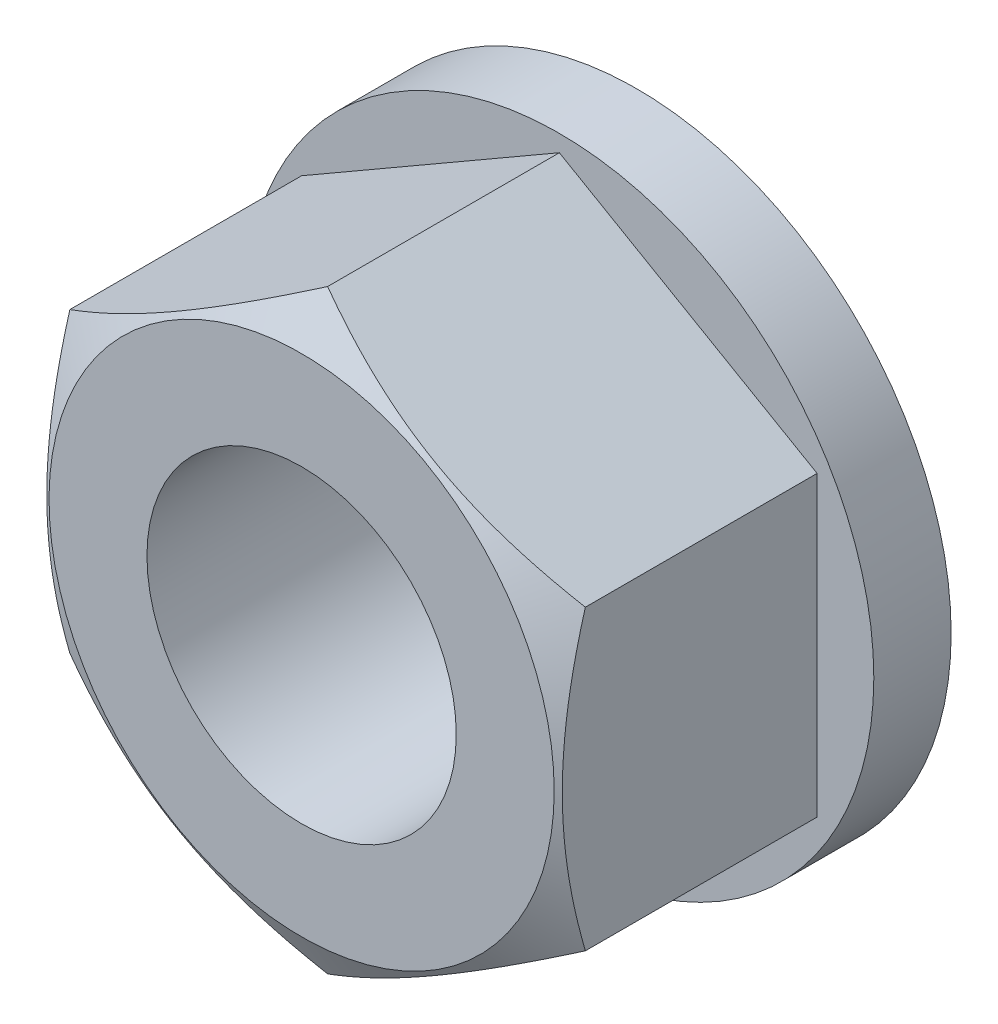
ISO-10303-21;
HEADER;
FILE_DESCRIPTION(('STEP AP214'),'2;1');
FILE_NAME('part.step','',(''),(''),'','','');
FILE_SCHEMA(('AUTOMOTIVE_DESIGN { 1 0 10303 214 1 1 1 1 }'));
ENDSEC;
DATA;
#1=APPLICATION_CONTEXT('core data for automotive mechanical design processes');
#2=APPLICATION_PROTOCOL_DEFINITION('international standard','automotive_design',2000,#1);
#3=PRODUCT_CONTEXT('',#1,'mechanical');
#4=PRODUCT('Part','Part','',(#3));
#5=PRODUCT_RELATED_PRODUCT_CATEGORY('part','',(#4));
#6=PRODUCT_DEFINITION_FORMATION('','',#4);
#7=PRODUCT_DEFINITION_CONTEXT('part definition',#1,'design');
#8=PRODUCT_DEFINITION('design','',#6,#7);
#9=PRODUCT_DEFINITION_SHAPE('','',#8);
#10=(LENGTH_UNIT() NAMED_UNIT(*) SI_UNIT(.MILLI.,.METRE.));
#11=(NAMED_UNIT(*) PLANE_ANGLE_UNIT() SI_UNIT($,.RADIAN.));
#12=(NAMED_UNIT(*) SI_UNIT($,.STERADIAN.) SOLID_ANGLE_UNIT());
#13=UNCERTAINTY_MEASURE_WITH_UNIT(LENGTH_MEASURE(1.E-05),#10,'distance_accuracy_value','');
#14=(GEOMETRIC_REPRESENTATION_CONTEXT(3) GLOBAL_UNCERTAINTY_ASSIGNED_CONTEXT((#13)) GLOBAL_UNIT_ASSIGNED_CONTEXT((#10,
#11,#12)) REPRESENTATION_CONTEXT('',''));
#15=CARTESIAN_POINT('',(0.,0.,0.));
#16=DIRECTION('',(0.,0.,1.));
#17=DIRECTION('',(1.,0.,0.));
#18=AXIS2_PLACEMENT_3D('',#15,#16,#17);
#19=CARTESIAN_POINT('',(5.,-5.842784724,6.5));
#20=DIRECTION('',(0.,0.,-1.));
#21=DIRECTION('',(-1.,0.,0.));
#22=AXIS2_PLACEMENT_3D('',#19,#20,#21);
#23=PLANE('',#22);
#24=CARTESIAN_POINT('',(0.,0.,6.5));
#25=DIRECTION('',(0.,0.,-1.));
#26=DIRECTION('',(0.,1.,0.));
#27=AXIS2_PLACEMENT_3D('',#24,#25,#26);
#28=CIRCLE('',#27,3.);
#29=CARTESIAN_POINT('',(0.,3.,6.5));
#30=VERTEX_POINT('',#29);
#31=EDGE_CURVE('E86',#30,#30,#28,.T.);
#32=ORIENTED_EDGE('',*,*,#31,.T.);
#33=EDGE_LOOP('',(#32));
#34=FACE_BOUND('',#33,.T.);
#35=CARTESIAN_POINT('',(0.,0.,6.5));
#36=DIRECTION('',(0.,0.,1.));
#37=DIRECTION('',(1.,0.,0.));
#38=AXIS2_PLACEMENT_3D('',#35,#36,#37);
#39=CIRCLE('',#38,4.9);
#40=CARTESIAN_POINT('',(4.9,0.,6.5));
#41=VERTEX_POINT('',#40);
#42=EDGE_CURVE('E219',#41,#41,#39,.T.);
#43=ORIENTED_EDGE('',*,*,#42,.T.);
#44=EDGE_LOOP('',(#43));
#45=FACE_BOUND('',#44,.T.);
#46=ADVANCED_FACE('F14',(#34,#45),#23,.F.);
#47=CARTESIAN_POINT('',(0.,-5.773502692,1.5));
#48=DIRECTION('',(0.500000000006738,0.866025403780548,0.));
#49=DIRECTION('',(-0.866025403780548,0.500000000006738,0.));
#50=AXIS2_PLACEMENT_3D('',#47,#48,#49);
#51=PLANE('',#50);
#52=CARTESIAN_POINT('',(-5.0002,-2.88663587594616,5.99561631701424));
#53=CARTESIAN_POINT('',(-4.78046540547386,-3.01349970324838,6.06887840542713));
#54=CARTESIAN_POINT('',(-4.55885141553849,-3.14144859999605,6.13551365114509));
#55=CARTESIAN_POINT('',(-4.11178600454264,-3.39956193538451,6.25182598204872));
#56=CARTESIAN_POINT('',(-3.88632664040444,-3.52973095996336,6.30146192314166));
#57=CARTESIAN_POINT('',(-3.43816769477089,-3.78847564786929,6.37871394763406));
#58=CARTESIAN_POINT('',(-3.21553790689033,-3.91701101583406,6.40684459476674));
#59=CARTESIAN_POINT('',(-2.88081009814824,-4.11026620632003,6.43207005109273));
#60=CARTESIAN_POINT('',(-2.76915780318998,-4.17472868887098,6.43765151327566));
#61=CARTESIAN_POINT('',(-2.54575002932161,-4.30371322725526,6.44306275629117));
#62=CARTESIAN_POINT('',(-2.4339945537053,-4.36823528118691,6.44289271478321));
#63=CARTESIAN_POINT('',(-2.12781576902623,-4.5450076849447,6.43451134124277));
#64=CARTESIAN_POINT('',(-1.93349391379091,-4.65719946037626,6.42043520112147));
#65=CARTESIAN_POINT('',(-1.54613989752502,-4.88083840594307,6.37579971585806));
#66=CARTESIAN_POINT('',(-1.35310909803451,-4.99228478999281,6.34522511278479));
#67=CARTESIAN_POINT('',(-0.964974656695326,-5.21637431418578,6.26879647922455));
#68=CARTESIAN_POINT('',(-0.769920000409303,-5.32898917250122,6.22261859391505));
#69=CARTESIAN_POINT('',(-0.382719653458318,-5.55253939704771,6.11781317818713));
#70=CARTESIAN_POINT('',(-0.190569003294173,-5.66347762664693,6.05921026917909));
#71=CARTESIAN_POINT('',(0.000200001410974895,-5.77361816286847,5.99561631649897));
#72=B_SPLINE_CURVE_WITH_KNOTS('',3,(#52,#53,#54,#55,#56,#57,#58,#59,#60,#61,#62,#63,#64,#65,#66,
#67,#68,#69,#70,#71),.UNSPECIFIED.,.F.,.F.,(4,2,2,2,2,2,2,2,2,4),(0.,0.792555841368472,
1.58701660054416,2.36181537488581,2.74884076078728,3.13585419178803,3.80962362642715,
4.48401723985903,5.17336882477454,5.86136694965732),.UNSPECIFIED.);
#73=CARTESIAN_POINT('',(-5.,-2.886751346,5.99568298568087));
#74=VERTEX_POINT('',#73);
#75=CARTESIAN_POINT('',(0.,-5.773502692,5.99568298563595));
#76=VERTEX_POINT('',#75);
#77=EDGE_CURVE('E100',#74,#76,#72,.T.);
#78=ORIENTED_EDGE('',*,*,#77,.F.);
#79=DIRECTION('',(0.,0.,-1.));
#80=VECTOR('',#79,1.);
#81=CARTESIAN_POINT('',(-5.,-2.886751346,4.));
#82=LINE('',#81,#80);
#83=CARTESIAN_POINT('',(-4.9999999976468,-2.88675134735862,1.5));
#84=VERTEX_POINT('',#83);
#85=EDGE_CURVE('E70',#74,#84,#82,.T.);
#86=ORIENTED_EDGE('',*,*,#85,.T.);
#87=DIRECTION('',(-0.866025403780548,0.500000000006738,0.));
#88=VECTOR('',#87,1.);
#89=CARTESIAN_POINT('',(0.,-5.773502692,1.5));
#90=LINE('',#89,#88);
#91=CARTESIAN_POINT('',(0.,-5.773502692,1.5));
#92=VERTEX_POINT('',#91);
#93=EDGE_CURVE('E64',#84,#92,#90,.F.);
#94=ORIENTED_EDGE('',*,*,#93,.T.);
#95=DIRECTION('',(0.,0.,1.));
#96=VECTOR('',#95,1.);
#97=CARTESIAN_POINT('',(0.,-5.773502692,4.));
#98=LINE('',#97,#96);
#99=EDGE_CURVE('E68',#92,#76,#98,.T.);
#100=ORIENTED_EDGE('',*,*,#99,.T.);
#101=EDGE_LOOP('',(#78,#86,#94,#100));
#102=FACE_BOUND('',#101,.T.);
#103=ADVANCED_FACE('F67',(#102),#51,.F.);
#104=CARTESIAN_POINT('',(5.,-2.886751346,1.5));
#105=DIRECTION('',(-0.500000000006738,0.866025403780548,0.));
#106=DIRECTION('',(-0.866025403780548,-0.500000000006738,0.));
#107=AXIS2_PLACEMENT_3D('',#104,#105,#106);
#108=PLANE('',#107);
#109=CARTESIAN_POINT('',(-0.000199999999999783,-5.77361816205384,5.99561631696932));
#110=CARTESIAN_POINT('',(0.219534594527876,-5.64675433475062,6.06887840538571));
#111=CARTESIAN_POINT('',(0.441148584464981,-5.51880543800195,6.13551365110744));
#112=CARTESIAN_POINT('',(0.888213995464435,-5.2606921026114,6.25182598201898));
#113=CARTESIAN_POINT('',(1.11367335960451,-5.13052307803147,6.30146192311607));
#114=CARTESIAN_POINT('',(1.56183230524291,-4.87177839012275,6.378713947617));
#115=CARTESIAN_POINT('',(1.78446209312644,-4.74324302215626,6.40684459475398));
#116=CARTESIAN_POINT('',(2.11918990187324,-4.54998783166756,6.43207005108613));
#117=CARTESIAN_POINT('',(2.23084219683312,-4.48552534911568,6.43765151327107));
#118=CARTESIAN_POINT('',(2.45424997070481,-4.35654081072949,6.44306275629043));
#119=CARTESIAN_POINT('',(2.56600544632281,-4.29201875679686,6.44289271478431));
#120=CARTESIAN_POINT('',(2.87218423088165,-4.11524635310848,6.43451134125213));
#121=CARTESIAN_POINT('',(3.06650608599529,-4.00305457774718,6.42043520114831));
#122=CARTESIAN_POINT('',(3.45386010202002,-3.7794156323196,6.37579971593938));
#123=CARTESIAN_POINT('',(3.64689090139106,-3.66796924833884,6.34522511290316));
#124=CARTESIAN_POINT('',(4.03502534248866,-3.44387972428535,6.26879647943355));
#125=CARTESIAN_POINT('',(4.23007999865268,-3.33126486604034,6.22261859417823));
#126=CARTESIAN_POINT('',(4.61728034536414,-3.10771464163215,6.1178131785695));
#127=CARTESIAN_POINT('',(4.80943099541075,-2.99677641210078,6.05921026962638));
#128=CARTESIAN_POINT('',(5.0002,-2.88663587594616,5.99561631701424));
#129=B_SPLINE_CURVE_WITH_KNOTS('',3,(#109,#110,#111,#112,#113,#114,#115,#116,#117,#118,#119,
#120,#121,#122,#123,#124,#125,#126,#127,#128),.UNSPECIFIED.,.F.,.F.,(4,2,2,2,2,2,2,2,2,4),(0.,
0.792555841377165,1.58701660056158,2.36181537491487,2.74884076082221,3.1358541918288,
3.80962362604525,4.48401723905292,5.17336882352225,5.86136694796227),.UNSPECIFIED.);
#130=CARTESIAN_POINT('',(5.,-2.886751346,5.99568298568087));
#131=VERTEX_POINT('',#130);
#132=EDGE_CURVE('E84',#76,#131,#129,.T.);
#133=ORIENTED_EDGE('',*,*,#132,.F.);
#134=ORIENTED_EDGE('',*,*,#99,.F.);
#135=DIRECTION('',(-0.866025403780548,-0.500000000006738,0.));
#136=VECTOR('',#135,1.);
#137=CARTESIAN_POINT('',(5.,-2.886751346,1.5));
#138=LINE('',#137,#136);
#139=CARTESIAN_POINT('',(4.9999999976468,-2.88675134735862,1.5));
#140=VERTEX_POINT('',#139);
#141=EDGE_CURVE('E75',#92,#140,#138,.F.);
#142=ORIENTED_EDGE('',*,*,#141,.T.);
#143=DIRECTION('',(0.,0.,1.));
#144=VECTOR('',#143,1.);
#145=CARTESIAN_POINT('',(5.,-2.886751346,4.));
#146=LINE('',#145,#144);
#147=EDGE_CURVE('E85',#140,#131,#146,.T.);
#148=ORIENTED_EDGE('',*,*,#147,.T.);
#149=EDGE_LOOP('',(#133,#134,#142,#148));
#150=FACE_BOUND('',#149,.T.);
#151=ADVANCED_FACE('F80',(#150),#108,.F.);
#152=CARTESIAN_POINT('',(5.,-2.886751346,1.5));
#153=DIRECTION('',(-1.,0.,0.));
#154=DIRECTION('',(0.,0.,1.));
#155=AXIS2_PLACEMENT_3D('',#152,#153,#154);
#156=PLANE('',#155);
#157=CARTESIAN_POINT('',(5.,-7.71834082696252,4.01950331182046));
#158=CARTESIAN_POINT('',(5.,-7.5002567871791,4.12514905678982));
#159=CARTESIAN_POINT('',(5.,-7.28166825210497,4.22977140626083));
#160=CARTESIAN_POINT('',(5.,-6.84321376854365,4.43639300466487));
#161=CARTESIAN_POINT('',(5.,-6.62334762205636,4.5383918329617));
#162=CARTESIAN_POINT('',(5.,-6.1809193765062,4.7397109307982));
#163=CARTESIAN_POINT('',(5.,-5.95834909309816,4.83901327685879));
#164=CARTESIAN_POINT('',(5.,-5.51142568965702,5.03350602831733));
#165=CARTESIAN_POINT('',(5.,-5.28707265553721,5.12869663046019));
#166=CARTESIAN_POINT('',(5.,-4.82912286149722,5.31679710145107));
#167=CARTESIAN_POINT('',(5.,-4.59545746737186,5.40954079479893));
#168=CARTESIAN_POINT('',(5.,-4.12537968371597,5.58792179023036));
#169=CARTESIAN_POINT('',(5.,-3.88896698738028,5.67355828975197));
#170=CARTESIAN_POINT('',(5.,-3.4134727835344,5.8354504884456));
#171=CARTESIAN_POINT('',(5.,-3.17439791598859,5.91172549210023));
#172=CARTESIAN_POINT('',(5.,-2.69281912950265,6.05242347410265));
#173=CARTESIAN_POINT('',(5.,-2.45031632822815,6.11685022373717));
#174=CARTESIAN_POINT('',(5.,-1.96308436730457,6.23039526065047));
#175=CARTESIAN_POINT('',(5.,-1.7183746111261,6.27959526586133));
#176=CARTESIAN_POINT('',(5.,-1.22594978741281,6.35988145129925));
#177=CARTESIAN_POINT('',(5.,-0.97823499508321,6.39096927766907));
#178=CARTESIAN_POINT('',(5.,-0.484257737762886,6.4321433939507));
#179=CARTESIAN_POINT('',(5.,-0.238018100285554,6.44249681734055));
#180=CARTESIAN_POINT('',(5.,0.254459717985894,6.4420253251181));
#181=CARTESIAN_POINT('',(5.,0.500697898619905,6.43119992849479));
#182=CARTESIAN_POINT('',(5.,0.919809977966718,6.39551065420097));
#183=CARTESIAN_POINT('',(5.,1.09313600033,6.37566179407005));
#184=CARTESIAN_POINT('',(5.,1.43848801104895,6.32672589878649));
#185=CARTESIAN_POINT('',(5.,1.61051381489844,6.29763757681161));
#186=CARTESIAN_POINT('',(5.,2.12442964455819,6.19804562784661));
#187=CARTESIAN_POINT('',(5.,2.46395942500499,6.11523415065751));
#188=CARTESIAN_POINT('',(5.,2.9715972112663,5.97203632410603));
#189=CARTESIAN_POINT('',(5.,3.14234672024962,5.9204842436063));
#190=CARTESIAN_POINT('',(5.,3.48218632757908,5.81212570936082));
#191=CARTESIAN_POINT('',(5.,3.65127641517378,5.75531922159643));
#192=CARTESIAN_POINT('',(5.,3.98785267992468,5.63735512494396));
#193=CARTESIAN_POINT('',(5.,4.15533938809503,5.57619901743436));
#194=CARTESIAN_POINT('',(5.,4.48893194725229,5.45024516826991));
#195=CARTESIAN_POINT('',(5.,4.65503781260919,5.38544746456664));
#196=CARTESIAN_POINT('',(5.,5.03948450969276,5.23139399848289));
#197=CARTESIAN_POINT('',(5.,5.25736772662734,5.14099851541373));
#198=CARTESIAN_POINT('',(5.,5.69134252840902,4.9559933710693));
#199=CARTESIAN_POINT('',(5.,5.90743401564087,4.86138348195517));
#200=CARTESIAN_POINT('',(5.,6.33814583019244,4.66877562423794));
#201=CARTESIAN_POINT('',(5.,6.55276587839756,4.57077703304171));
#202=CARTESIAN_POINT('',(5.,6.98073939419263,4.37204819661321));
#203=CARTESIAN_POINT('',(5.,7.19409283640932,4.27131789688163));
#204=CARTESIAN_POINT('',(5.,7.83295674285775,3.96561939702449));
#205=CARTESIAN_POINT('',(5.,8.25687393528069,3.75732344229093));
#206=CARTESIAN_POINT('',(5.,9.10167850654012,3.3346764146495));
#207=CARTESIAN_POINT('',(5.,9.52256577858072,3.12032512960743));
#208=CARTESIAN_POINT('',(5.,10.1352241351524,2.80431118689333));
#209=CARTESIAN_POINT('',(5.,10.3278796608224,2.70435819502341));
#210=CARTESIAN_POINT('',(5.,10.7127712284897,2.50365598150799));
#211=CARTESIAN_POINT('',(5.,10.9050072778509,2.40290677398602));
#212=CARTESIAN_POINT('',(5.,11.481185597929,2.09961618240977));
#213=CARTESIAN_POINT('',(5.,11.864583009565,1.8960396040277));
#214=CARTESIAN_POINT('',(5.,12.629349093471,1.4872567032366));
#215=CARTESIAN_POINT('',(5.,13.0107204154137,1.28205532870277));
#216=CARTESIAN_POINT('',(5.,13.7725380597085,0.869989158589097));
#217=CARTESIAN_POINT('',(5.,14.1529844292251,0.663124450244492));
#218=CARTESIAN_POINT('',(5.,14.5330880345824,0.455635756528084));
#219=B_SPLINE_CURVE_WITH_KNOTS('',3,(#157,#158,#159,#160,#161,#162,#163,#164,#165,#166,#167,
#168,#169,#170,#171,#172,#173,#174,#175,#176,#177,#178,#179,#180,#181,#182,#183,#184,#185,#186,
#187,#188,#189,#190,#191,#192,#193,#194,#195,#196,#197,#198,#199,#200,#201,#202,#203,#204,#205,
#206,#207,#208,#209,#210,#211,#212,#213,#214,#215,#216,#217,#218),.UNSPECIFIED.,.F.,.F.,(4,2,2,
2,2,2,2,2,2,2,2,2,2,2,2,2,2,2,2,2,2,2,2,2,2,2,2,2,2,2,4),(0.,0.726985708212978,1.45408725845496,
2.18520812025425,2.91629395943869,3.67039836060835,4.42458780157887,5.1771949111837,
5.92956205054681,6.67781846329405,7.42600685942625,8.16449224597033,8.90299440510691,
9.42611642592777,9.94931133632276,10.9962971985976,11.5313392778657,12.066384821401,
12.6012465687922,13.1361027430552,13.8437160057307,14.5513675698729,15.2591498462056,
15.9669462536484,17.3838458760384,18.8007951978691,19.451916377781,20.1030260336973,
21.4052961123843,22.7045090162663,24.0036542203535),.UNSPECIFIED.);
#220=CARTESIAN_POINT('',(5.,2.886751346,5.99568298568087));
#221=VERTEX_POINT('',#220);
#222=EDGE_CURVE('E105',#131,#221,#219,.T.);
#223=ORIENTED_EDGE('',*,*,#222,.F.);
#224=ORIENTED_EDGE('',*,*,#147,.F.);
#225=DIRECTION('',(0.,1.,0.));
#226=VECTOR('',#225,1.);
#227=CARTESIAN_POINT('',(4.9999999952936,0.,1.5));
#228=LINE('',#227,#226);
#229=CARTESIAN_POINT('',(4.9999999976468,2.88675134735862,1.5));
#230=VERTEX_POINT('',#229);
#231=EDGE_CURVE('E91',#140,#230,#228,.T.);
#232=ORIENTED_EDGE('',*,*,#231,.T.);
#233=DIRECTION('',(0.,0.,1.));
#234=VECTOR('',#233,1.);
#235=CARTESIAN_POINT('',(5.,2.886751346,4.));
#236=LINE('',#235,#234);
#237=EDGE_CURVE('E210',#230,#221,#236,.T.);
#238=ORIENTED_EDGE('',*,*,#237,.T.);
#239=EDGE_LOOP('',(#223,#224,#232,#238));
#240=FACE_BOUND('',#239,.T.);
#241=ADVANCED_FACE('F156',(#240),#156,.F.);
#242=CARTESIAN_POINT('',(0.,5.773502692,1.5));
#243=DIRECTION('',(-0.500000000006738,-0.866025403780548,0.));
#244=DIRECTION('',(0.866025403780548,-0.500000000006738,0.));
#245=AXIS2_PLACEMENT_3D('',#242,#243,#244);
#246=PLANE('',#245);
#247=CARTESIAN_POINT('',(5.0002,2.88663587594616,5.99561631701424));
#248=CARTESIAN_POINT('',(4.78046540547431,3.01349970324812,6.06887840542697));
#249=CARTESIAN_POINT('',(4.55885141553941,3.14144859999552,6.13551365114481));
#250=CARTESIAN_POINT('',(4.11178600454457,3.3995619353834,6.25182598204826));
#251=CARTESIAN_POINT('',(3.8863266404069,3.52973095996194,6.30146192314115));
#252=CARTESIAN_POINT('',(3.43816769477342,3.78847564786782,6.37871394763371));
#253=CARTESIAN_POINT('',(3.21553790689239,3.91701101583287,6.40684459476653));
#254=CARTESIAN_POINT('',(2.88081009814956,4.11026620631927,6.43207005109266));
#255=CARTESIAN_POINT('',(2.76915780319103,4.17472868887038,6.43765151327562));
#256=CARTESIAN_POINT('',(2.54575002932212,4.30371322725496,6.44306275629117));
#257=CARTESIAN_POINT('',(2.43399455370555,4.36823528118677,6.4428927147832));
#258=CARTESIAN_POINT('',(2.12781576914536,4.54500768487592,6.43451134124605));
#259=CARTESIAN_POINT('',(1.93349391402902,4.65719946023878,6.4204352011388));
#260=CARTESIAN_POINT('',(1.54613989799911,4.88083840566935,6.37579971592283));
#261=CARTESIAN_POINT('',(1.35310909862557,4.99228478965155,6.34522511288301));
#262=CARTESIAN_POINT('',(0.96497465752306,5.21637431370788,6.26879647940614));
#263=CARTESIAN_POINT('',(0.769920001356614,5.32898917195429,6.22261859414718));
#264=CARTESIAN_POINT('',(0.38271965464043,5.55253939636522,6.11781317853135));
#265=CARTESIAN_POINT('',(0.190569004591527,5.6634776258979,6.05921026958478));
#266=CARTESIAN_POINT('',(-0.000200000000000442,5.77361816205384,5.99561631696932));
#267=B_SPLINE_CURVE_WITH_KNOTS('',3,(#247,#248,#249,#250,#251,#252,#253,#254,#255,#256,#257,
#258,#259,#260,#261,#262,#263,#264,#265,#266),.UNSPECIFIED.,.F.,.F.,(4,2,2,2,2,2,2,2,2,4),(0.,
0.792555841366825,1.58701660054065,2.36181537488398,2.74884076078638,3.13585419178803,
3.80962362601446,4.48401723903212,5.1733688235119,5.86136694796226),.UNSPECIFIED.);
#268=CARTESIAN_POINT('',(0.,5.773502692,5.99568298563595));
#269=VERTEX_POINT('',#268);
#270=EDGE_CURVE('E144',#221,#269,#267,.T.);
#271=ORIENTED_EDGE('',*,*,#270,.F.);
#272=ORIENTED_EDGE('',*,*,#237,.F.);
#273=DIRECTION('',(0.866025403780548,-0.500000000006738,0.));
#274=VECTOR('',#273,1.);
#275=CARTESIAN_POINT('',(0.,5.773502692,1.5));
#276=LINE('',#275,#274);
#277=CARTESIAN_POINT('',(0.,5.773502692,1.5));
#278=VERTEX_POINT('',#277);
#279=EDGE_CURVE('E93',#230,#278,#276,.F.);
#280=ORIENTED_EDGE('',*,*,#279,.T.);
#281=DIRECTION('',(0.,0.,1.));
#282=VECTOR('',#281,1.);
#283=CARTESIAN_POINT('',(0.,5.773502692,4.));
#284=LINE('',#283,#282);
#285=EDGE_CURVE('E119',#278,#269,#284,.T.);
#286=ORIENTED_EDGE('',*,*,#285,.T.);
#287=EDGE_LOOP('',(#271,#272,#280,#286));
#288=FACE_BOUND('',#287,.T.);
#289=ADVANCED_FACE('F159',(#288),#246,.F.);
#290=CARTESIAN_POINT('',(-5.,2.886751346,1.5));
#291=DIRECTION('',(0.500000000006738,-0.866025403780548,0.));
#292=DIRECTION('',(0.866025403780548,0.500000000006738,0.));
#293=AXIS2_PLACEMENT_3D('',#290,#291,#292);
#294=PLANE('',#293);
#295=CARTESIAN_POINT('',(0.000200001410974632,5.77361816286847,5.99561631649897));
#296=CARTESIAN_POINT('',(-0.219534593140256,5.64675433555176,6.06887840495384));
#297=CARTESIAN_POINT('',(-0.441148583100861,5.51880543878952,6.13551365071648));
#298=CARTESIAN_POINT('',(-0.888213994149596,5.26069210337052,6.25182598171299));
#299=CARTESIAN_POINT('',(-1.11367335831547,5.1305230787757,6.3014619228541));
#300=CARTESIAN_POINT('',(-1.56183230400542,4.87177839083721,6.37871394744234));
#301=CARTESIAN_POINT('',(-1.78446209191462,4.7432430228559,6.40684459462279));
#302=CARTESIAN_POINT('',(-2.11918990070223,4.54998783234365,6.43207005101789));
#303=CARTESIAN_POINT('',(-2.23084219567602,4.48552534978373,6.43765151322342));
#304=CARTESIAN_POINT('',(-2.45424996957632,4.35654081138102,6.44306275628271));
#305=CARTESIAN_POINT('',(-2.56600544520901,4.29201875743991,6.44289271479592));
#306=CARTESIAN_POINT('',(-2.87218422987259,4.11524635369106,6.4345113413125));
#307=CARTESIAN_POINT('',(-3.06650608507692,4.0030545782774,6.42043520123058));
#308=CARTESIAN_POINT('',(-3.45386010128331,3.77941563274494,6.37579971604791));
#309=CARTESIAN_POINT('',(-3.64689090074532,3.66796924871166,6.34522511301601));
#310=CARTESIAN_POINT('',(-4.03502534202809,3.44387972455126,6.26879647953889));
#311=CARTESIAN_POINT('',(-4.23007999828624,3.3312648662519,6.22261859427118));
#312=CARTESIAN_POINT('',(-4.61728034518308,3.10771464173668,6.11781317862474));
#313=CARTESIAN_POINT('',(-4.80943099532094,2.99677641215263,6.05921026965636));
#314=CARTESIAN_POINT('',(-5.0002,2.88663587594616,5.99561631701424));
#315=B_SPLINE_CURVE_WITH_KNOTS('',3,(#295,#296,#297,#298,#299,#300,#301,#302,#303,#304,#305,
#306,#307,#308,#309,#310,#311,#312,#313,#314),.UNSPECIFIED.,.F.,.F.,(4,2,2,2,2,2,2,2,2,4),(0.,
0.792555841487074,1.58701660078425,2.36181537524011,2.74884076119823,3.1358541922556,
3.80962362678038,4.48401724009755,5.17336882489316,5.86136694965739),.UNSPECIFIED.);
#316=CARTESIAN_POINT('',(-5.,2.886751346,5.99568298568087));
#317=VERTEX_POINT('',#316);
#318=EDGE_CURVE('E34',#269,#317,#315,.T.);
#319=ORIENTED_EDGE('',*,*,#318,.F.);
#320=ORIENTED_EDGE('',*,*,#285,.F.);
#321=DIRECTION('',(0.866025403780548,0.500000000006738,0.));
#322=VECTOR('',#321,1.);
#323=CARTESIAN_POINT('',(-5.,2.886751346,1.5));
#324=LINE('',#323,#322);
#325=CARTESIAN_POINT('',(-4.9999999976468,2.88675134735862,1.5));
#326=VERTEX_POINT('',#325);
#327=EDGE_CURVE('E43',#278,#326,#324,.F.);
#328=ORIENTED_EDGE('',*,*,#327,.T.);
#329=DIRECTION('',(0.,0.,1.));
#330=VECTOR('',#329,1.);
#331=CARTESIAN_POINT('',(-5.,2.886751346,4.));
#332=LINE('',#331,#330);
#333=EDGE_CURVE('E211',#326,#317,#332,.T.);
#334=ORIENTED_EDGE('',*,*,#333,.T.);
#335=EDGE_LOOP('',(#319,#320,#328,#334));
#336=FACE_BOUND('',#335,.T.);
#337=ADVANCED_FACE('F164',(#336),#294,.F.);
#338=CARTESIAN_POINT('',(-5.,-2.886751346,6.5));
#339=DIRECTION('',(1.,0.,0.));
#340=DIRECTION('',(0.,0.,-1.));
#341=AXIS2_PLACEMENT_3D('',#338,#339,#340);
#342=PLANE('',#341);
#343=CARTESIAN_POINT('',(-5.,-7.71834082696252,4.01950331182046));
#344=CARTESIAN_POINT('',(-5.,-7.5002567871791,4.12514905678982));
#345=CARTESIAN_POINT('',(-5.,-7.28166825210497,4.22977140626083));
#346=CARTESIAN_POINT('',(-5.,-6.84321376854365,4.43639300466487));
#347=CARTESIAN_POINT('',(-5.,-6.62334762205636,4.5383918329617));
#348=CARTESIAN_POINT('',(-5.,-6.1809193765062,4.7397109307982));
#349=CARTESIAN_POINT('',(-5.,-5.95834909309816,4.83901327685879));
#350=CARTESIAN_POINT('',(-5.,-5.51142568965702,5.03350602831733));
#351=CARTESIAN_POINT('',(-5.,-5.28707265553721,5.12869663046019));
#352=CARTESIAN_POINT('',(-5.,-4.82912286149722,5.31679710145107));
#353=CARTESIAN_POINT('',(-5.,-4.59545746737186,5.40954079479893));
#354=CARTESIAN_POINT('',(-5.,-4.12537968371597,5.58792179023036));
#355=CARTESIAN_POINT('',(-5.,-3.88896698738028,5.67355828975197));
#356=CARTESIAN_POINT('',(-5.,-3.4134727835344,5.8354504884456));
#357=CARTESIAN_POINT('',(-5.,-3.17439791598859,5.91172549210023));
#358=CARTESIAN_POINT('',(-5.,-2.69281912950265,6.05242347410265));
#359=CARTESIAN_POINT('',(-5.,-2.45031632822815,6.11685022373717));
#360=CARTESIAN_POINT('',(-5.,-1.96308436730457,6.23039526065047));
#361=CARTESIAN_POINT('',(-5.,-1.7183746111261,6.27959526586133));
#362=CARTESIAN_POINT('',(-5.,-1.22594978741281,6.35988145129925));
#363=CARTESIAN_POINT('',(-5.,-0.97823499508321,6.39096927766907));
#364=CARTESIAN_POINT('',(-5.,-0.484257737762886,6.4321433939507));
#365=CARTESIAN_POINT('',(-5.,-0.238018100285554,6.44249681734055));
#366=CARTESIAN_POINT('',(-5.,0.254459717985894,6.4420253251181));
#367=CARTESIAN_POINT('',(-5.,0.500697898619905,6.43119992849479));
#368=CARTESIAN_POINT('',(-5.,0.919809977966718,6.39551065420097));
#369=CARTESIAN_POINT('',(-5.,1.09313600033,6.37566179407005));
#370=CARTESIAN_POINT('',(-5.,1.43848801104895,6.32672589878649));
#371=CARTESIAN_POINT('',(-5.,1.61051381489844,6.29763757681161));
#372=CARTESIAN_POINT('',(-5.,2.12442964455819,6.19804562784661));
#373=CARTESIAN_POINT('',(-5.,2.46395942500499,6.11523415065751));
#374=CARTESIAN_POINT('',(-5.,2.9715972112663,5.97203632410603));
#375=CARTESIAN_POINT('',(-5.,3.14234672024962,5.9204842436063));
#376=CARTESIAN_POINT('',(-5.,3.48218632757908,5.81212570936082));
#377=CARTESIAN_POINT('',(-5.,3.65127641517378,5.75531922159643));
#378=CARTESIAN_POINT('',(-5.,3.98785267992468,5.63735512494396));
#379=CARTESIAN_POINT('',(-5.,4.15533938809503,5.57619901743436));
#380=CARTESIAN_POINT('',(-5.,4.48893194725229,5.45024516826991));
#381=CARTESIAN_POINT('',(-5.,4.65503781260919,5.38544746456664));
#382=CARTESIAN_POINT('',(-5.,5.03948450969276,5.23139399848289));
#383=CARTESIAN_POINT('',(-5.,5.25736772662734,5.14099851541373));
#384=CARTESIAN_POINT('',(-5.,5.69134252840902,4.9559933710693));
#385=CARTESIAN_POINT('',(-5.,5.90743401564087,4.86138348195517));
#386=CARTESIAN_POINT('',(-5.,6.33814583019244,4.66877562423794));
#387=CARTESIAN_POINT('',(-5.,6.55276587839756,4.57077703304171));
#388=CARTESIAN_POINT('',(-5.,6.98073939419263,4.37204819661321));
#389=CARTESIAN_POINT('',(-5.,7.19409283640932,4.27131789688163));
#390=CARTESIAN_POINT('',(-5.,7.83295674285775,3.96561939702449));
#391=CARTESIAN_POINT('',(-5.,8.25687393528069,3.75732344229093));
#392=CARTESIAN_POINT('',(-5.,9.10167850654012,3.3346764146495));
#393=CARTESIAN_POINT('',(-5.,9.52256577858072,3.12032512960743));
#394=CARTESIAN_POINT('',(-5.,10.1352241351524,2.80431118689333));
#395=CARTESIAN_POINT('',(-5.,10.3278796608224,2.70435819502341));
#396=CARTESIAN_POINT('',(-5.,10.7127712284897,2.50365598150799));
#397=CARTESIAN_POINT('',(-5.,10.9050072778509,2.40290677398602));
#398=CARTESIAN_POINT('',(-5.,11.481185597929,2.09961618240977));
#399=CARTESIAN_POINT('',(-5.,11.864583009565,1.8960396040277));
#400=CARTESIAN_POINT('',(-5.,12.629349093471,1.4872567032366));
#401=CARTESIAN_POINT('',(-5.,13.0107204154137,1.28205532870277));
#402=CARTESIAN_POINT('',(-5.,13.7725380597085,0.869989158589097));
#403=CARTESIAN_POINT('',(-5.,14.1529844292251,0.663124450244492));
#404=CARTESIAN_POINT('',(-5.,14.5330880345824,0.455635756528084));
#405=B_SPLINE_CURVE_WITH_KNOTS('',3,(#343,#344,#345,#346,#347,#348,#349,#350,#351,#352,#353,
#354,#355,#356,#357,#358,#359,#360,#361,#362,#363,#364,#365,#366,#367,#368,#369,#370,#371,#372,
#373,#374,#375,#376,#377,#378,#379,#380,#381,#382,#383,#384,#385,#386,#387,#388,#389,#390,#391,
#392,#393,#394,#395,#396,#397,#398,#399,#400,#401,#402,#403,#404),.UNSPECIFIED.,.F.,.F.,(4,2,2,
2,2,2,2,2,2,2,2,2,2,2,2,2,2,2,2,2,2,2,2,2,2,2,2,2,2,2,4),(0.,0.726985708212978,1.45408725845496,
2.18520812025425,2.91629395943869,3.67039836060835,4.42458780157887,5.1771949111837,
5.92956205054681,6.67781846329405,7.42600685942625,8.16449224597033,8.90299440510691,
9.42611642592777,9.94931133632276,10.9962971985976,11.5313392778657,12.066384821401,
12.6012465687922,13.1361027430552,13.8437160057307,14.5513675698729,15.2591498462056,
15.9669462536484,17.3838458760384,18.8007951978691,19.451916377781,20.1030260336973,
21.4052961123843,22.7045090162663,24.0036542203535),.UNSPECIFIED.);
#406=EDGE_CURVE('E9',#317,#74,#405,.F.);
#407=ORIENTED_EDGE('',*,*,#406,.F.);
#408=ORIENTED_EDGE('',*,*,#333,.F.);
#409=DIRECTION('',(0.,-1.,0.));
#410=VECTOR('',#409,1.);
#411=CARTESIAN_POINT('',(-4.9999999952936,0.,1.5));
#412=LINE('',#411,#410);
#413=EDGE_CURVE('E200',#326,#84,#412,.T.);
#414=ORIENTED_EDGE('',*,*,#413,.T.);
#415=ORIENTED_EDGE('',*,*,#85,.F.);
#416=EDGE_LOOP('',(#407,#408,#414,#415));
#417=FACE_BOUND('',#416,.T.);
#418=ADVANCED_FACE('F168',(#417),#342,.F.);
#419=CARTESIAN_POINT('',(0.,0.,6.5));
#420=DIRECTION('',(0.,0.,-1.));
#421=DIRECTION('',(0.,1.,0.));
#422=AXIS2_PLACEMENT_3D('',#419,#420,#421);
#423=CYLINDRICAL_SURFACE('',#422,3.);
#424=CARTESIAN_POINT('',(0.,0.,0.));
#425=DIRECTION('',(0.,0.,-1.));
#426=DIRECTION('',(0.,1.,0.));
#427=AXIS2_PLACEMENT_3D('',#424,#425,#426);
#428=CIRCLE('',#427,3.);
#429=CARTESIAN_POINT('',(0.,3.,0.));
#430=VERTEX_POINT('',#429);
#431=EDGE_CURVE('E76',#430,#430,#428,.F.);
#432=ORIENTED_EDGE('',*,*,#431,.F.);
#433=EDGE_LOOP('',(#432));
#434=FACE_BOUND('',#433,.T.);
#435=ORIENTED_EDGE('',*,*,#31,.F.);
#436=EDGE_LOOP('',(#435));
#437=FACE_BOUND('',#436,.T.);
#438=ADVANCED_FACE('F129',(#434,#437),#423,.F.);
#439=CARTESIAN_POINT('',(6.1732,-6.194441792,0.));
#440=DIRECTION('',(0.,0.,-1.));
#441=DIRECTION('',(-1.,0.,0.));
#442=AXIS2_PLACEMENT_3D('',#439,#440,#441);
#443=PLANE('',#442);
#444=ORIENTED_EDGE('',*,*,#431,.T.);
#445=EDGE_LOOP('',(#444));
#446=FACE_BOUND('',#445,.T.);
#447=CARTESIAN_POINT('',(0.,0.,0.));
#448=DIRECTION('',(0.,0.,1.));
#449=DIRECTION('',(1.,0.,0.));
#450=AXIS2_PLACEMENT_3D('',#447,#448,#449);
#451=CIRCLE('',#450,6.1);
#452=CARTESIAN_POINT('',(6.1,0.,0.));
#453=VERTEX_POINT('',#452);
#454=EDGE_CURVE('E199',#453,#453,#451,.T.);
#455=ORIENTED_EDGE('',*,*,#454,.F.);
#456=EDGE_LOOP('',(#455));
#457=FACE_BOUND('',#456,.T.);
#458=ADVANCED_FACE('F172',(#446,#457),#443,.T.);
#459=CARTESIAN_POINT('',(6.1732,-6.194441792,1.5));
#460=DIRECTION('',(0.,0.,-1.));
#461=DIRECTION('',(-1.,0.,0.));
#462=AXIS2_PLACEMENT_3D('',#459,#460,#461);
#463=PLANE('',#462);
#464=ORIENTED_EDGE('',*,*,#327,.F.);
#465=ORIENTED_EDGE('',*,*,#279,.F.);
#466=ORIENTED_EDGE('',*,*,#231,.F.);
#467=ORIENTED_EDGE('',*,*,#141,.F.);
#468=ORIENTED_EDGE('',*,*,#93,.F.);
#469=ORIENTED_EDGE('',*,*,#413,.F.);
#470=EDGE_LOOP('',(#464,#465,#466,#467,#468,#469));
#471=FACE_BOUND('',#470,.T.);
#472=CARTESIAN_POINT('',(0.,0.,1.5));
#473=DIRECTION('',(0.,0.,1.));
#474=DIRECTION('',(1.,0.,0.));
#475=AXIS2_PLACEMENT_3D('',#472,#473,#474);
#476=CIRCLE('',#475,6.1);
#477=CARTESIAN_POINT('',(6.1,0.,1.5));
#478=VERTEX_POINT('',#477);
#479=EDGE_CURVE('E28',#478,#478,#476,.F.);
#480=ORIENTED_EDGE('',*,*,#479,.F.);
#481=EDGE_LOOP('',(#480));
#482=FACE_BOUND('',#481,.T.);
#483=ADVANCED_FACE('F16',(#471,#482),#463,.F.);
#484=CARTESIAN_POINT('',(0.,0.,0.));
#485=DIRECTION('',(0.,0.,1.));
#486=DIRECTION('',(1.,0.,0.));
#487=AXIS2_PLACEMENT_3D('',#484,#485,#486);
#488=CYLINDRICAL_SURFACE('',#487,6.1);
#489=ORIENTED_EDGE('',*,*,#479,.T.);
#490=EDGE_LOOP('',(#489));
#491=FACE_BOUND('',#490,.T.);
#492=ORIENTED_EDGE('',*,*,#454,.T.);
#493=EDGE_LOOP('',(#492));
#494=FACE_BOUND('',#493,.T.);
#495=ADVANCED_FACE('F127',(#491,#494),#488,.T.);
#496=CARTESIAN_POINT('',(0.,0.,6.5));
#497=DIRECTION('',(0.,0.,-1.));
#498=DIRECTION('',(-1.,0.,0.));
#499=AXIS2_PLACEMENT_3D('',#496,#497,#498);
#500=CONICAL_SURFACE('',#499,4.9,1.0471975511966);
#501=ORIENTED_EDGE('',*,*,#42,.F.);
#502=EDGE_LOOP('',(#501));
#503=FACE_BOUND('',#502,.T.);
#504=ORIENTED_EDGE('',*,*,#77,.T.);
#505=ORIENTED_EDGE('',*,*,#132,.T.);
#506=ORIENTED_EDGE('',*,*,#222,.T.);
#507=ORIENTED_EDGE('',*,*,#270,.T.);
#508=ORIENTED_EDGE('',*,*,#318,.T.);
#509=ORIENTED_EDGE('',*,*,#406,.T.);
#510=EDGE_LOOP('',(#504,#505,#506,#507,#508,#509));
#511=FACE_BOUND('',#510,.T.);
#512=ADVANCED_FACE('F123',(#503,#511),#500,.T.);
#513=CLOSED_SHELL('',(#46,#103,#151,#241,#289,#337,#418,#438,#458,#483,#495,#512));
#514=MANIFOLD_SOLID_BREP('B1',#513);
#515=ADVANCED_BREP_SHAPE_REPRESENTATION('',(#18,#514),#14);
#516=SHAPE_DEFINITION_REPRESENTATION(#9,#515);
ENDSEC;
END-ISO-10303-21;
